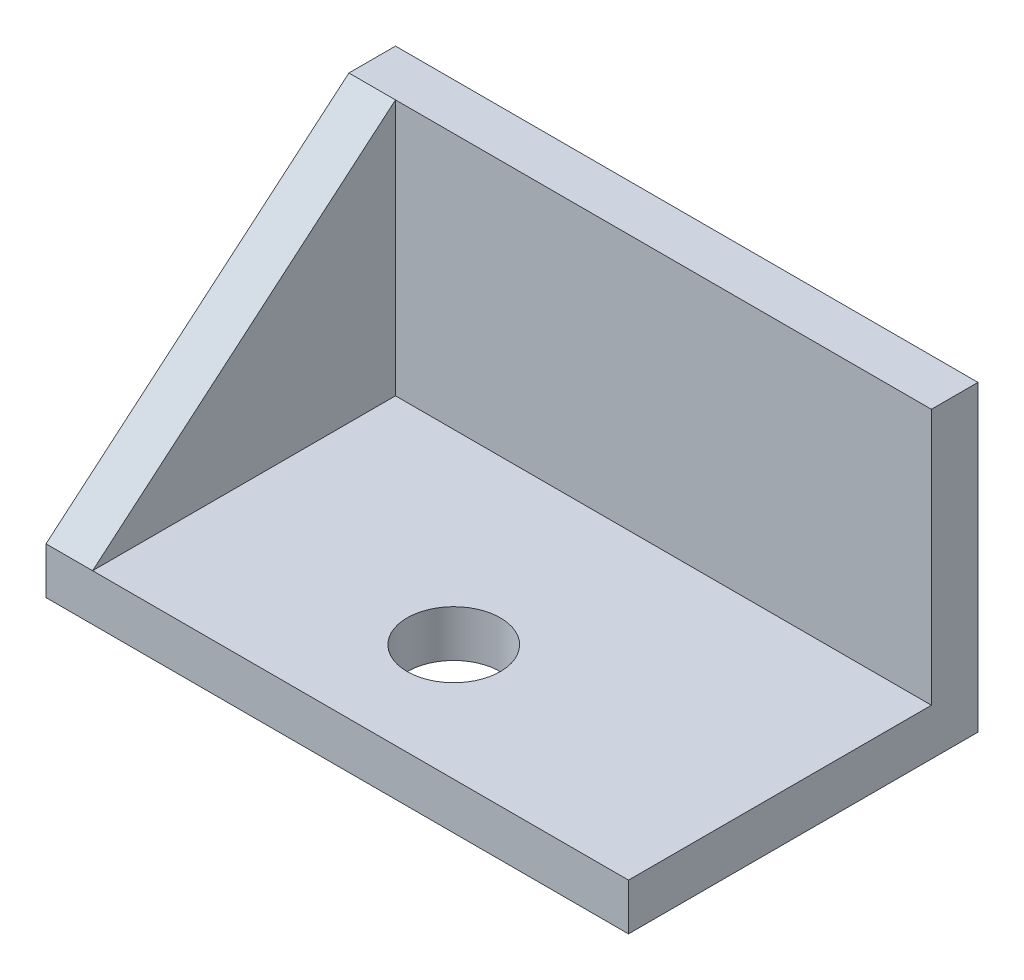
ISO-10303-21;
HEADER;
FILE_DESCRIPTION(('STEP AP214'),'2;1');
FILE_NAME('part.step','',(''),(''),'','','');
FILE_SCHEMA(('AUTOMOTIVE_DESIGN { 1 0 10303 214 1 1 1 1 }'));
ENDSEC;
DATA;
#1=APPLICATION_CONTEXT('core data for automotive mechanical design processes');
#2=APPLICATION_PROTOCOL_DEFINITION('international standard','automotive_design',2000,#1);
#3=PRODUCT_CONTEXT('',#1,'mechanical');
#4=PRODUCT('Part','Part','',(#3));
#5=PRODUCT_RELATED_PRODUCT_CATEGORY('part','',(#4));
#6=PRODUCT_DEFINITION_FORMATION('','',#4);
#7=PRODUCT_DEFINITION_CONTEXT('part definition',#1,'design');
#8=PRODUCT_DEFINITION('design','',#6,#7);
#9=PRODUCT_DEFINITION_SHAPE('','',#8);
#10=(LENGTH_UNIT() NAMED_UNIT(*) SI_UNIT(.MILLI.,.METRE.));
#11=(NAMED_UNIT(*) PLANE_ANGLE_UNIT() SI_UNIT($,.RADIAN.));
#12=(NAMED_UNIT(*) SI_UNIT($,.STERADIAN.) SOLID_ANGLE_UNIT());
#13=UNCERTAINTY_MEASURE_WITH_UNIT(LENGTH_MEASURE(1.E-05),#10,'distance_accuracy_value','');
#14=(GEOMETRIC_REPRESENTATION_CONTEXT(3) GLOBAL_UNCERTAINTY_ASSIGNED_CONTEXT((#13)) GLOBAL_UNIT_ASSIGNED_CONTEXT((#10,
#11,#12)) REPRESENTATION_CONTEXT('',''));
#15=CARTESIAN_POINT('',(0.,0.,0.));
#16=DIRECTION('',(0.,0.,1.));
#17=DIRECTION('',(1.,0.,0.));
#18=AXIS2_PLACEMENT_3D('',#15,#16,#17);
#19=CARTESIAN_POINT('',(0.,0.,75.));
#20=DIRECTION('',(1.,0.,0.));
#21=DIRECTION('',(0.,0.,-1.));
#22=AXIS2_PLACEMENT_3D('',#19,#20,#21);
#23=PLANE('',#22);
#24=DIRECTION('',(0.,-1.,0.));
#25=VECTOR('',#24,1.);
#26=CARTESIAN_POINT('',(0.,0.,75.));
#27=LINE('',#26,#25);
#28=CARTESIAN_POINT('',(0.,10.,75.));
#29=VERTEX_POINT('',#28);
#30=CARTESIAN_POINT('',(0.,0.,75.));
#31=VERTEX_POINT('',#30);
#32=EDGE_CURVE('E141',#29,#31,#27,.T.);
#33=ORIENTED_EDGE('',*,*,#32,.F.);
#34=DIRECTION('',(0.,0.645942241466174,-0.763386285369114));
#35=VECTOR('',#34,1.);
#36=CARTESIAN_POINT('',(0.,10.,75.));
#37=LINE('',#36,#35);
#38=CARTESIAN_POINT('',(0.,65.,10.));
#39=VERTEX_POINT('',#38);
#40=EDGE_CURVE('E68',#29,#39,#37,.T.);
#41=ORIENTED_EDGE('',*,*,#40,.T.);
#42=DIRECTION('',(0.,0.,-1.));
#43=VECTOR('',#42,1.);
#44=CARTESIAN_POINT('',(0.,65.,75.));
#45=LINE('',#44,#43);
#46=CARTESIAN_POINT('',(0.,65.,0.));
#47=VERTEX_POINT('',#46);
#48=EDGE_CURVE('E150',#39,#47,#45,.T.);
#49=ORIENTED_EDGE('',*,*,#48,.T.);
#50=DIRECTION('',(0.,-1.,0.));
#51=VECTOR('',#50,1.);
#52=CARTESIAN_POINT('',(0.,0.,0.));
#53=LINE('',#52,#51);
#54=CARTESIAN_POINT('',(0.,0.,0.));
#55=VERTEX_POINT('',#54);
#56=EDGE_CURVE('E136',#47,#55,#53,.T.);
#57=ORIENTED_EDGE('',*,*,#56,.T.);
#58=DIRECTION('',(0.,0.,-1.));
#59=VECTOR('',#58,1.);
#60=CARTESIAN_POINT('',(0.,0.,75.));
#61=LINE('',#60,#59);
#62=EDGE_CURVE('E11',#31,#55,#61,.T.);
#63=ORIENTED_EDGE('',*,*,#62,.F.);
#64=EDGE_LOOP('',(#33,#41,#49,#57,#63));
#65=FACE_BOUND('',#64,.T.);
#66=ADVANCED_FACE('F45',(#65),#23,.F.);
#67=CARTESIAN_POINT('',(0.,0.,75.));
#68=DIRECTION('',(0.,1.,0.));
#69=DIRECTION('',(0.,0.,1.));
#70=AXIS2_PLACEMENT_3D('',#67,#68,#69);
#71=PLANE('',#70);
#72=CARTESIAN_POINT('',(62.5,0.,50.));
#73=DIRECTION('',(0.,1.,0.));
#74=DIRECTION('',(0.,0.,1.));
#75=AXIS2_PLACEMENT_3D('',#72,#73,#74);
#76=CIRCLE('',#75,9.99999999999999);
#77=CARTESIAN_POINT('',(62.5,0.,60.));
#78=VERTEX_POINT('',#77);
#79=EDGE_CURVE('E191',#78,#78,#76,.T.);
#80=ORIENTED_EDGE('',*,*,#79,.T.);
#81=EDGE_LOOP('',(#80));
#82=FACE_BOUND('',#81,.T.);
#83=DIRECTION('',(1.,0.,0.));
#84=VECTOR('',#83,1.);
#85=CARTESIAN_POINT('',(0.,0.,0.));
#86=LINE('',#85,#84);
#87=CARTESIAN_POINT('',(125.,0.,0.));
#88=VERTEX_POINT('',#87);
#89=EDGE_CURVE('E154',#55,#88,#86,.T.);
#90=ORIENTED_EDGE('',*,*,#89,.T.);
#91=DIRECTION('',(0.,0.,-1.));
#92=VECTOR('',#91,1.);
#93=CARTESIAN_POINT('',(125.,0.,75.));
#94=LINE('',#93,#92);
#95=CARTESIAN_POINT('',(125.,0.,75.));
#96=VERTEX_POINT('',#95);
#97=EDGE_CURVE('E53',#96,#88,#94,.T.);
#98=ORIENTED_EDGE('',*,*,#97,.F.);
#99=DIRECTION('',(1.,0.,0.));
#100=VECTOR('',#99,1.);
#101=CARTESIAN_POINT('',(0.,0.,75.));
#102=LINE('',#101,#100);
#103=EDGE_CURVE('E144',#31,#96,#102,.T.);
#104=ORIENTED_EDGE('',*,*,#103,.F.);
#105=ORIENTED_EDGE('',*,*,#62,.T.);
#106=EDGE_LOOP('',(#90,#98,#104,#105));
#107=FACE_BOUND('',#106,.T.);
#108=ADVANCED_FACE('F209',(#82,#107),#71,.F.);
#109=CARTESIAN_POINT('',(125.,0.,75.));
#110=DIRECTION('',(-1.,0.,0.));
#111=DIRECTION('',(0.,0.,1.));
#112=AXIS2_PLACEMENT_3D('',#109,#110,#111);
#113=PLANE('',#112);
#114=DIRECTION('',(0.,0.,-1.));
#115=VECTOR('',#114,1.);
#116=CARTESIAN_POINT('',(125.,65.,75.));
#117=LINE('',#116,#115);
#118=CARTESIAN_POINT('',(125.,65.,10.));
#119=VERTEX_POINT('',#118);
#120=CARTESIAN_POINT('',(125.,65.,0.));
#121=VERTEX_POINT('',#120);
#122=EDGE_CURVE('E166',#119,#121,#117,.T.);
#123=ORIENTED_EDGE('',*,*,#122,.F.);
#124=DIRECTION('',(0.,1.,0.));
#125=VECTOR('',#124,1.);
#126=CARTESIAN_POINT('',(125.,65.,10.));
#127=LINE('',#126,#125);
#128=CARTESIAN_POINT('',(125.,10.,9.99999999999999));
#129=VERTEX_POINT('',#128);
#130=EDGE_CURVE('E119',#129,#119,#127,.T.);
#131=ORIENTED_EDGE('',*,*,#130,.F.);
#132=DIRECTION('',(0.,0.,-1.));
#133=VECTOR('',#132,1.);
#134=CARTESIAN_POINT('',(125.,10.,9.99999999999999));
#135=LINE('',#134,#133);
#136=CARTESIAN_POINT('',(125.,10.,75.));
#137=VERTEX_POINT('',#136);
#138=EDGE_CURVE('E186',#137,#129,#135,.T.);
#139=ORIENTED_EDGE('',*,*,#138,.F.);
#140=DIRECTION('',(0.,1.,0.));
#141=VECTOR('',#140,1.);
#142=CARTESIAN_POINT('',(125.,0.,75.));
#143=LINE('',#142,#141);
#144=EDGE_CURVE('E127',#96,#137,#143,.T.);
#145=ORIENTED_EDGE('',*,*,#144,.F.);
#146=ORIENTED_EDGE('',*,*,#97,.T.);
#147=DIRECTION('',(0.,1.,0.));
#148=VECTOR('',#147,1.);
#149=CARTESIAN_POINT('',(125.,0.,0.));
#150=LINE('',#149,#148);
#151=EDGE_CURVE('E157',#88,#121,#150,.T.);
#152=ORIENTED_EDGE('',*,*,#151,.T.);
#153=EDGE_LOOP('',(#123,#131,#139,#145,#146,#152));
#154=FACE_BOUND('',#153,.T.);
#155=ADVANCED_FACE('F174',(#154),#113,.F.);
#156=CARTESIAN_POINT('',(0.,65.,75.));
#157=DIRECTION('',(0.,-1.,0.));
#158=DIRECTION('',(0.,0.,-1.));
#159=AXIS2_PLACEMENT_3D('',#156,#157,#158);
#160=PLANE('',#159);
#161=ORIENTED_EDGE('',*,*,#48,.F.);
#162=DIRECTION('',(1.,0.,0.));
#163=VECTOR('',#162,1.);
#164=CARTESIAN_POINT('',(0.,65.,10.));
#165=LINE('',#164,#163);
#166=CARTESIAN_POINT('',(9.99999999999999,65.,10.));
#167=VERTEX_POINT('',#166);
#168=EDGE_CURVE('E132',#39,#167,#165,.T.);
#169=ORIENTED_EDGE('',*,*,#168,.T.);
#170=DIRECTION('',(1.,0.,0.));
#171=VECTOR('',#170,1.);
#172=CARTESIAN_POINT('',(9.99999999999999,65.,10.));
#173=LINE('',#172,#171);
#174=EDGE_CURVE('E138',#167,#119,#173,.T.);
#175=ORIENTED_EDGE('',*,*,#174,.T.);
#176=ORIENTED_EDGE('',*,*,#122,.T.);
#177=DIRECTION('',(-1.,0.,0.));
#178=VECTOR('',#177,1.);
#179=CARTESIAN_POINT('',(0.,65.,0.));
#180=LINE('',#179,#178);
#181=EDGE_CURVE('E145',#121,#47,#180,.T.);
#182=ORIENTED_EDGE('',*,*,#181,.T.);
#183=EDGE_LOOP('',(#161,#169,#175,#176,#182));
#184=FACE_BOUND('',#183,.T.);
#185=ADVANCED_FACE('F183',(#184),#160,.F.);
#186=CARTESIAN_POINT('',(0.,0.,75.));
#187=DIRECTION('',(0.,0.,-1.));
#188=DIRECTION('',(-1.,0.,0.));
#189=AXIS2_PLACEMENT_3D('',#186,#187,#188);
#190=PLANE('',#189);
#191=ORIENTED_EDGE('',*,*,#144,.T.);
#192=DIRECTION('',(1.,0.,0.));
#193=VECTOR('',#192,1.);
#194=CARTESIAN_POINT('',(9.99999999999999,10.,75.));
#195=LINE('',#194,#193);
#196=CARTESIAN_POINT('',(9.99999999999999,10.,75.));
#197=VERTEX_POINT('',#196);
#198=EDGE_CURVE('E109',#197,#137,#195,.T.);
#199=ORIENTED_EDGE('',*,*,#198,.F.);
#200=DIRECTION('',(1.,0.,0.));
#201=VECTOR('',#200,1.);
#202=CARTESIAN_POINT('',(0.,10.,75.));
#203=LINE('',#202,#201);
#204=EDGE_CURVE('E124',#29,#197,#203,.T.);
#205=ORIENTED_EDGE('',*,*,#204,.F.);
#206=ORIENTED_EDGE('',*,*,#32,.T.);
#207=ORIENTED_EDGE('',*,*,#103,.T.);
#208=EDGE_LOOP('',(#191,#199,#205,#206,#207));
#209=FACE_BOUND('',#208,.T.);
#210=ADVANCED_FACE('F123',(#209),#190,.F.);
#211=CARTESIAN_POINT('',(0.,0.,0.));
#212=DIRECTION('',(0.,0.,-1.));
#213=DIRECTION('',(-1.,0.,0.));
#214=AXIS2_PLACEMENT_3D('',#211,#212,#213);
#215=PLANE('',#214);
#216=ORIENTED_EDGE('',*,*,#56,.F.);
#217=ORIENTED_EDGE('',*,*,#181,.F.);
#218=ORIENTED_EDGE('',*,*,#151,.F.);
#219=ORIENTED_EDGE('',*,*,#89,.F.);
#220=EDGE_LOOP('',(#216,#217,#218,#219));
#221=FACE_BOUND('',#220,.T.);
#222=ADVANCED_FACE('F180',(#221),#215,.T.);
#223=CARTESIAN_POINT('',(0.,10.,75.));
#224=DIRECTION('',(0.,-0.763386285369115,-0.645942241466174));
#225=DIRECTION('',(0.,0.645942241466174,-0.763386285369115));
#226=AXIS2_PLACEMENT_3D('',#223,#224,#225);
#227=PLANE('',#226);
#228=ORIENTED_EDGE('',*,*,#204,.T.);
#229=DIRECTION('',(0.,-0.645942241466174,0.763386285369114));
#230=VECTOR('',#229,1.);
#231=CARTESIAN_POINT('',(9.99999999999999,10.,75.));
#232=LINE('',#231,#230);
#233=EDGE_CURVE('E113',#167,#197,#232,.T.);
#234=ORIENTED_EDGE('',*,*,#233,.F.);
#235=ORIENTED_EDGE('',*,*,#168,.F.);
#236=ORIENTED_EDGE('',*,*,#40,.F.);
#237=EDGE_LOOP('',(#228,#234,#235,#236));
#238=FACE_BOUND('',#237,.T.);
#239=ADVANCED_FACE('F130',(#238),#227,.F.);
#240=CARTESIAN_POINT('',(9.99999999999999,65.,10.));
#241=DIRECTION('',(0.,0.,-1.));
#242=DIRECTION('',(0.,1.,0.));
#243=AXIS2_PLACEMENT_3D('',#240,#241,#242);
#244=PLANE('',#243);
#245=ORIENTED_EDGE('',*,*,#130,.T.);
#246=ORIENTED_EDGE('',*,*,#174,.F.);
#247=DIRECTION('',(0.,1.,0.));
#248=VECTOR('',#247,1.);
#249=CARTESIAN_POINT('',(9.99999999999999,65.,10.));
#250=LINE('',#249,#248);
#251=CARTESIAN_POINT('',(9.99999999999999,10.,9.99999999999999));
#252=VERTEX_POINT('',#251);
#253=EDGE_CURVE('E60',#252,#167,#250,.T.);
#254=ORIENTED_EDGE('',*,*,#253,.F.);
#255=DIRECTION('',(1.,0.,0.));
#256=VECTOR('',#255,1.);
#257=CARTESIAN_POINT('',(9.99999999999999,10.,9.99999999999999));
#258=LINE('',#257,#256);
#259=EDGE_CURVE('E111',#252,#129,#258,.T.);
#260=ORIENTED_EDGE('',*,*,#259,.T.);
#261=EDGE_LOOP('',(#245,#246,#254,#260));
#262=FACE_BOUND('',#261,.T.);
#263=ADVANCED_FACE('F198',(#262),#244,.F.);
#264=CARTESIAN_POINT('',(9.99999999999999,10.,9.99999999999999));
#265=DIRECTION('',(0.,-1.,0.));
#266=DIRECTION('',(0.,0.,-1.));
#267=AXIS2_PLACEMENT_3D('',#264,#265,#266);
#268=PLANE('',#267);
#269=CARTESIAN_POINT('',(62.5,10.,50.));
#270=DIRECTION('',(0.,1.,0.));
#271=DIRECTION('',(0.,0.,1.));
#272=AXIS2_PLACEMENT_3D('',#269,#270,#271);
#273=CIRCLE('',#272,9.99999999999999);
#274=CARTESIAN_POINT('',(62.5,10.,60.));
#275=VERTEX_POINT('',#274);
#276=EDGE_CURVE('E201',#275,#275,#273,.T.);
#277=ORIENTED_EDGE('',*,*,#276,.F.);
#278=EDGE_LOOP('',(#277));
#279=FACE_BOUND('',#278,.T.);
#280=ORIENTED_EDGE('',*,*,#138,.T.);
#281=ORIENTED_EDGE('',*,*,#259,.F.);
#282=DIRECTION('',(0.,0.,-1.));
#283=VECTOR('',#282,1.);
#284=CARTESIAN_POINT('',(9.99999999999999,10.,9.99999999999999));
#285=LINE('',#284,#283);
#286=EDGE_CURVE('E105',#197,#252,#285,.T.);
#287=ORIENTED_EDGE('',*,*,#286,.F.);
#288=ORIENTED_EDGE('',*,*,#198,.T.);
#289=EDGE_LOOP('',(#280,#281,#287,#288));
#290=FACE_BOUND('',#289,.T.);
#291=ADVANCED_FACE('F107',(#279,#290),#268,.F.);
#292=CARTESIAN_POINT('',(9.99999999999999,0.,0.));
#293=DIRECTION('',(-1.,0.,0.));
#294=DIRECTION('',(0.,0.,1.));
#295=AXIS2_PLACEMENT_3D('',#292,#293,#294);
#296=PLANE('',#295);
#297=ORIENTED_EDGE('',*,*,#233,.T.);
#298=ORIENTED_EDGE('',*,*,#286,.T.);
#299=ORIENTED_EDGE('',*,*,#253,.T.);
#300=EDGE_LOOP('',(#297,#298,#299));
#301=FACE_BOUND('',#300,.T.);
#302=ADVANCED_FACE('F116',(#301),#296,.F.);
#303=CARTESIAN_POINT('',(62.5,0.,50.));
#304=DIRECTION('',(0.,1.,0.));
#305=DIRECTION('',(0.,0.,1.));
#306=AXIS2_PLACEMENT_3D('',#303,#304,#305);
#307=CYLINDRICAL_SURFACE('',#306,9.99999999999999);
#308=ORIENTED_EDGE('',*,*,#79,.F.);
#309=EDGE_LOOP('',(#308));
#310=FACE_BOUND('',#309,.T.);
#311=ORIENTED_EDGE('',*,*,#276,.T.);
#312=EDGE_LOOP('',(#311));
#313=FACE_BOUND('',#312,.T.);
#314=ADVANCED_FACE('F211',(#310,#313),#307,.F.);
#315=CLOSED_SHELL('',(#66,#108,#155,#185,#210,#222,#239,#263,#291,#302,#314));
#316=MANIFOLD_SOLID_BREP('B2',#315);
#317=ADVANCED_BREP_SHAPE_REPRESENTATION('',(#18,#316),#14);
#318=SHAPE_DEFINITION_REPRESENTATION(#9,#317);
ENDSEC;
END-ISO-10303-21;
